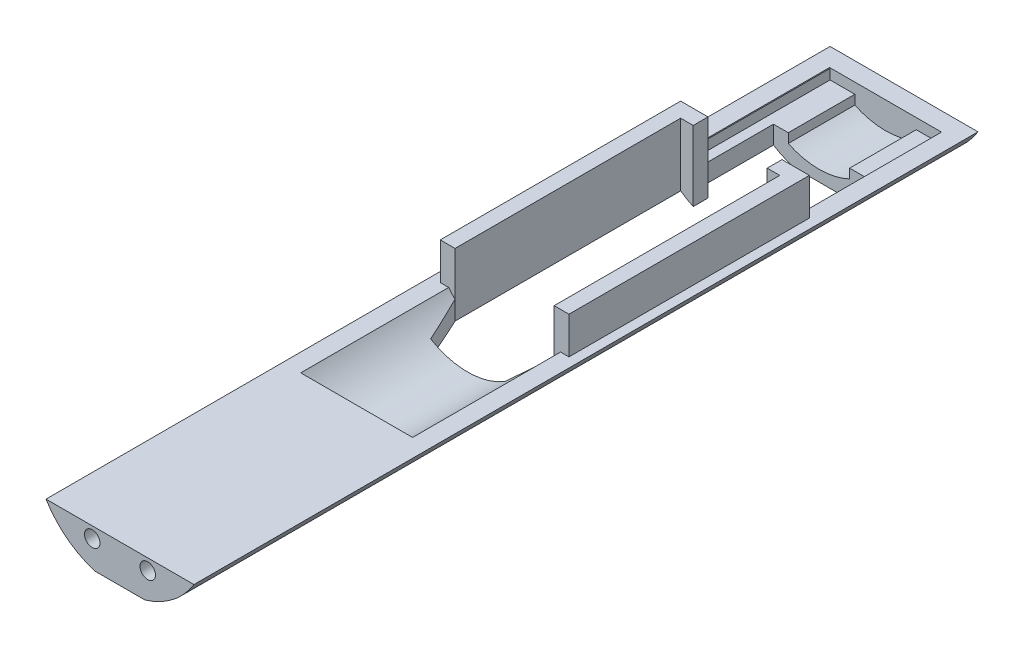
ISO-10303-21;
HEADER;
FILE_DESCRIPTION(('STEP AP214'),'2;1');
FILE_NAME('part.step','',(''),(''),'','','');
FILE_SCHEMA(('AUTOMOTIVE_DESIGN { 1 0 10303 214 1 1 1 1 }'));
ENDSEC;
DATA;
#1=APPLICATION_CONTEXT('core data for automotive mechanical design processes');
#2=APPLICATION_PROTOCOL_DEFINITION('international standard','automotive_design',2000,#1);
#3=PRODUCT_CONTEXT('',#1,'mechanical');
#4=PRODUCT('Part','Part','',(#3));
#5=PRODUCT_RELATED_PRODUCT_CATEGORY('part','',(#4));
#6=PRODUCT_DEFINITION_FORMATION('','',#4);
#7=PRODUCT_DEFINITION_CONTEXT('part definition',#1,'design');
#8=PRODUCT_DEFINITION('design','',#6,#7);
#9=PRODUCT_DEFINITION_SHAPE('','',#8);
#10=(LENGTH_UNIT() NAMED_UNIT(*) SI_UNIT(.MILLI.,.METRE.));
#11=(NAMED_UNIT(*) PLANE_ANGLE_UNIT() SI_UNIT($,.RADIAN.));
#12=(NAMED_UNIT(*) SI_UNIT($,.STERADIAN.) SOLID_ANGLE_UNIT());
#13=UNCERTAINTY_MEASURE_WITH_UNIT(LENGTH_MEASURE(1.E-05),#10,'distance_accuracy_value','');
#14=(GEOMETRIC_REPRESENTATION_CONTEXT(3) GLOBAL_UNCERTAINTY_ASSIGNED_CONTEXT((#13)) GLOBAL_UNIT_ASSIGNED_CONTEXT((#10,
#11,#12)) REPRESENTATION_CONTEXT('',''));
#15=CARTESIAN_POINT('',(0.,0.,0.));
#16=DIRECTION('',(0.,0.,1.));
#17=DIRECTION('',(1.,0.,0.));
#18=AXIS2_PLACEMENT_3D('',#15,#16,#17);
#19=CARTESIAN_POINT('',(0.,0.,-457.2));
#20=DIRECTION('',(0.,0.,1.));
#21=DIRECTION('',(1.,0.,0.));
#22=AXIS2_PLACEMENT_3D('',#19,#20,#21);
#23=CYLINDRICAL_SURFACE('',#22,29.718);
#24=CARTESIAN_POINT('',(0.,0.,-457.2));
#25=DIRECTION('',(0.,0.,1.));
#26=DIRECTION('',(1.,0.,0.));
#27=AXIS2_PLACEMENT_3D('',#24,#25,#26);
#28=CIRCLE('',#27,29.718);
#29=CARTESIAN_POINT('',(-8.59481355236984,-28.448,-457.2));
#30=VERTEX_POINT('',#29);
#31=CARTESIAN_POINT('',(-25.4,-15.4272331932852,-457.2));
#32=VERTEX_POINT('',#31);
#33=EDGE_CURVE('E483',#30,#32,#28,.F.);
#34=ORIENTED_EDGE('',*,*,#33,.F.);
#35=DIRECTION('',(0.,0.,1.));
#36=VECTOR('',#35,1.);
#37=CARTESIAN_POINT('',(-8.59481355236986,-28.448,-457.2));
#38=LINE('',#37,#36);
#39=CARTESIAN_POINT('',(-8.59481355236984,-28.448,-427.99));
#40=VERTEX_POINT('',#39);
#41=EDGE_CURVE('E719',#30,#40,#38,.T.);
#42=ORIENTED_EDGE('',*,*,#41,.T.);
#43=CARTESIAN_POINT('',(0.,0.,-427.99));
#44=DIRECTION('',(0.,0.,-1.));
#45=DIRECTION('',(-1.,0.,0.));
#46=AXIS2_PLACEMENT_3D('',#43,#44,#45);
#47=CIRCLE('',#46,29.718);
#48=CARTESIAN_POINT('',(-15.6246134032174,-25.2790620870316,-427.99));
#49=VERTEX_POINT('',#48);
#50=EDGE_CURVE('E533',#40,#49,#47,.T.);
#51=ORIENTED_EDGE('',*,*,#50,.T.);
#52=DIRECTION('',(0.,0.,1.));
#53=VECTOR('',#52,1.);
#54=CARTESIAN_POINT('',(-15.6246134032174,-25.2790620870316,-457.2));
#55=LINE('',#54,#53);
#56=CARTESIAN_POINT('',(-15.6246134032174,-25.2790620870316,-402.59));
#57=VERTEX_POINT('',#56);
#58=EDGE_CURVE('E89',#49,#57,#55,.T.);
#59=ORIENTED_EDGE('',*,*,#58,.T.);
#60=CARTESIAN_POINT('',(0.,0.,-402.59));
#61=DIRECTION('',(0.,0.,1.));
#62=DIRECTION('',(1.,0.,0.));
#63=AXIS2_PLACEMENT_3D('',#60,#61,#62);
#64=CIRCLE('',#63,29.718);
#65=CARTESIAN_POINT('',(-12.7,-26.8676296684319,-402.59));
#66=VERTEX_POINT('',#65);
#67=EDGE_CURVE('E544',#57,#66,#64,.T.);
#68=ORIENTED_EDGE('',*,*,#67,.T.);
#69=DIRECTION('',(0.,0.,1.));
#70=VECTOR('',#69,1.);
#71=CARTESIAN_POINT('',(-12.7,-26.8676296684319,-457.2));
#72=LINE('',#71,#70);
#73=CARTESIAN_POINT('',(-12.7,-26.8676296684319,-397.51));
#74=VERTEX_POINT('',#73);
#75=EDGE_CURVE('E595',#66,#74,#72,.T.);
#76=ORIENTED_EDGE('',*,*,#75,.T.);
#77=CARTESIAN_POINT('',(0.,0.,-397.51));
#78=DIRECTION('',(0.,0.,-1.));
#79=DIRECTION('',(-1.,0.,0.));
#80=AXIS2_PLACEMENT_3D('',#77,#78,#79);
#81=CIRCLE('',#80,29.718);
#82=CARTESIAN_POINT('',(-17.018,-24.3628241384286,-397.51));
#83=VERTEX_POINT('',#82);
#84=EDGE_CURVE('E519',#74,#83,#81,.T.);
#85=ORIENTED_EDGE('',*,*,#84,.T.);
#86=DIRECTION('',(0.,0.,1.));
#87=VECTOR('',#86,1.);
#88=CARTESIAN_POINT('',(-17.018,-24.3628241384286,-457.2));
#89=LINE('',#88,#87);
#90=CARTESIAN_POINT('',(-17.018,-24.3628241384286,-320.04));
#91=VERTEX_POINT('',#90);
#92=EDGE_CURVE('E524',#83,#91,#89,.T.);
#93=ORIENTED_EDGE('',*,*,#92,.T.);
#94=CARTESIAN_POINT('',(0.,0.,-269.987058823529));
#95=DIRECTION('',(-0.946772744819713,0.,0.321902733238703));
#96=DIRECTION('',(0.321902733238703,0.,0.946772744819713));
#97=AXIS2_PLACEMENT_3D('',#94,#95,#96);
#98=ELLIPSE('',#97,92.3198125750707,29.718);
#99=CARTESIAN_POINT('',(-12.7,-26.8676296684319,-307.34));
#100=VERTEX_POINT('',#99);
#101=EDGE_CURVE('E529',#91,#100,#98,.T.);
#102=ORIENTED_EDGE('',*,*,#101,.T.);
#103=CARTESIAN_POINT('',(0.,0.,-307.34));
#104=DIRECTION('',(0.,0.,1.));
#105=DIRECTION('',(1.,0.,0.));
#106=AXIS2_PLACEMENT_3D('',#103,#104,#105);
#107=CIRCLE('',#106,29.718);
#108=CARTESIAN_POINT('',(-8.59481355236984,-28.448,-307.34));
#109=VERTEX_POINT('',#108);
#110=EDGE_CURVE('E506',#100,#109,#107,.T.);
#111=ORIENTED_EDGE('',*,*,#110,.T.);
#112=CARTESIAN_POINT('',(-8.59481355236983,-28.448,-187.96));
#113=VERTEX_POINT('',#112);
#114=EDGE_CURVE('E93',#109,#113,#38,.T.);
#115=ORIENTED_EDGE('',*,*,#114,.T.);
#116=CARTESIAN_POINT('',(0.,0.,-187.96));
#117=DIRECTION('',(0.,0.,-1.));
#118=DIRECTION('',(-1.,0.,0.));
#119=AXIS2_PLACEMENT_3D('',#116,#117,#118);
#120=CIRCLE('',#119,29.718);
#121=CARTESIAN_POINT('',(-25.4,-15.4272331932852,-187.96));
#122=VERTEX_POINT('',#121);
#123=EDGE_CURVE('E335',#113,#122,#120,.T.);
#124=ORIENTED_EDGE('',*,*,#123,.T.);
#125=DIRECTION('',(0.,0.,1.));
#126=VECTOR('',#125,1.);
#127=CARTESIAN_POINT('',(-25.4,-15.4272331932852,-457.2));
#128=LINE('',#127,#126);
#129=EDGE_CURVE('E494',#32,#122,#128,.T.);
#130=ORIENTED_EDGE('',*,*,#129,.F.);
#131=EDGE_LOOP('',(#34,#42,#51,#59,#68,#76,#85,#93,#102,#111,#115,#124,#130));
#132=FACE_BOUND('',#131,.T.);
#133=ADVANCED_FACE('F79',(#132),#23,.T.);
#134=CARTESIAN_POINT('',(25.3999999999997,-286.302365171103,-187.96));
#135=DIRECTION('',(0.,0.,-1.));
#136=DIRECTION('',(-1.,0.,0.));
#137=AXIS2_PLACEMENT_3D('',#134,#135,#136);
#138=PLANE('',#137);
#139=CARTESIAN_POINT('',(9.52500000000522,-19.2372331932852,-187.96));
#140=DIRECTION('',(0.,0.,1.));
#141=DIRECTION('',(1.,0.,0.));
#142=AXIS2_PLACEMENT_3D('',#139,#140,#141);
#143=CIRCLE('',#142,2.64999999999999);
#144=CARTESIAN_POINT('',(12.1750000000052,-19.2372331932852,-187.96));
#145=VERTEX_POINT('',#144);
#146=EDGE_CURVE('E704',#145,#145,#143,.T.);
#147=ORIENTED_EDGE('',*,*,#146,.F.);
#148=EDGE_LOOP('',(#147));
#149=FACE_BOUND('',#148,.T.);
#150=CARTESIAN_POINT('',(-9.52499999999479,-19.2372331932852,-187.96));
#151=DIRECTION('',(0.,0.,1.));
#152=DIRECTION('',(1.,0.,0.));
#153=AXIS2_PLACEMENT_3D('',#150,#151,#152);
#154=CIRCLE('',#153,2.64999999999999);
#155=CARTESIAN_POINT('',(-6.8749999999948,-19.2372331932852,-187.96));
#156=VERTEX_POINT('',#155);
#157=EDGE_CURVE('E706',#156,#156,#154,.T.);
#158=ORIENTED_EDGE('',*,*,#157,.F.);
#159=EDGE_LOOP('',(#158));
#160=FACE_BOUND('',#159,.T.);
#161=DIRECTION('',(-1.,0.,0.));
#162=VECTOR('',#161,1.);
#163=CARTESIAN_POINT('',(0.,-28.448,-187.96));
#164=LINE('',#163,#162);
#165=CARTESIAN_POINT('',(8.59481355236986,-28.448,-187.96));
#166=VERTEX_POINT('',#165);
#167=EDGE_CURVE('E316',#166,#113,#164,.T.);
#168=ORIENTED_EDGE('',*,*,#167,.F.);
#169=CARTESIAN_POINT('',(25.4,-15.4272331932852,-187.96));
#170=VERTEX_POINT('',#169);
#171=EDGE_CURVE('E332',#170,#166,#120,.T.);
#172=ORIENTED_EDGE('',*,*,#171,.F.);
#173=DIRECTION('',(-1.,0.,0.));
#174=VECTOR('',#173,1.);
#175=CARTESIAN_POINT('',(25.4,-15.4272331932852,-187.96));
#176=LINE('',#175,#174);
#177=EDGE_CURVE('E476',#170,#122,#176,.T.);
#178=ORIENTED_EDGE('',*,*,#177,.T.);
#179=ORIENTED_EDGE('',*,*,#123,.F.);
#180=EDGE_LOOP('',(#168,#172,#178,#179));
#181=FACE_BOUND('',#180,.T.);
#182=ADVANCED_FACE('F328',(#149,#160,#181),#138,.F.);
#183=CARTESIAN_POINT('',(25.4,-29.719,-450.85));
#184=DIRECTION('',(0.,0.,1.));
#185=DIRECTION('',(1.,0.,0.));
#186=AXIS2_PLACEMENT_3D('',#183,#184,#185);
#187=PLANE('',#186);
#188=DIRECTION('',(-1.,0.,0.));
#189=VECTOR('',#188,1.);
#190=CARTESIAN_POINT('',(-19.05,-19.05,-450.85));
#191=LINE('',#190,#189);
#192=CARTESIAN_POINT('',(-10.5446134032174,-19.05,-450.85));
#193=VERTEX_POINT('',#192);
#194=CARTESIAN_POINT('',(-19.05,-19.05,-450.85));
#195=VERTEX_POINT('',#194);
#196=EDGE_CURVE('E618',#193,#195,#191,.T.);
#197=ORIENTED_EDGE('',*,*,#196,.F.);
#198=DIRECTION('',(0.,1.,0.));
#199=VECTOR('',#198,1.);
#200=CARTESIAN_POINT('',(-10.5446134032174,-29.719,-450.85));
#201=LINE('',#200,#199);
#202=CARTESIAN_POINT('',(-10.5446134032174,-22.2675138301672,-450.85));
#203=VERTEX_POINT('',#202);
#204=EDGE_CURVE('E690',#203,#193,#201,.T.);
#205=ORIENTED_EDGE('',*,*,#204,.F.);
#206=CARTESIAN_POINT('',(0.,0.,-450.85));
#207=DIRECTION('',(0.,0.,1.));
#208=DIRECTION('',(1.,0.,0.));
#209=AXIS2_PLACEMENT_3D('',#206,#207,#208);
#210=CIRCLE('',#209,24.638);
#211=CARTESIAN_POINT('',(10.5446134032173,-22.2675138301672,-450.85));
#212=VERTEX_POINT('',#211);
#213=EDGE_CURVE('E379',#203,#212,#210,.T.);
#214=ORIENTED_EDGE('',*,*,#213,.T.);
#215=DIRECTION('',(0.,1.,0.));
#216=VECTOR('',#215,1.);
#217=CARTESIAN_POINT('',(10.5446134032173,-29.719,-450.85));
#218=LINE('',#217,#216);
#219=CARTESIAN_POINT('',(10.5446134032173,-19.05,-450.85));
#220=VERTEX_POINT('',#219);
#221=EDGE_CURVE('E681',#212,#220,#218,.T.);
#222=ORIENTED_EDGE('',*,*,#221,.T.);
#223=CARTESIAN_POINT('',(19.05,-19.05,-450.85));
#224=VERTEX_POINT('',#223);
#225=EDGE_CURVE('E615',#224,#220,#191,.T.);
#226=ORIENTED_EDGE('',*,*,#225,.F.);
#227=DIRECTION('',(0.,-1.,0.));
#228=VECTOR('',#227,1.);
#229=CARTESIAN_POINT('',(19.05,-19.05,-450.85));
#230=LINE('',#229,#228);
#231=CARTESIAN_POINT('',(19.05,-15.6246134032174,-450.85));
#232=VERTEX_POINT('',#231);
#233=EDGE_CURVE('E609',#232,#224,#230,.T.);
#234=ORIENTED_EDGE('',*,*,#233,.F.);
#235=CARTESIAN_POINT('',(19.2101931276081,-15.4272331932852,-450.85));
#236=VERTEX_POINT('',#235);
#237=EDGE_CURVE('E372',#232,#236,#210,.T.);
#238=ORIENTED_EDGE('',*,*,#237,.T.);
#239=DIRECTION('',(1.,0.,0.));
#240=VECTOR('',#239,1.);
#241=CARTESIAN_POINT('',(25.4,-15.4272331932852,-450.85));
#242=LINE('',#241,#240);
#243=CARTESIAN_POINT('',(-19.2101931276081,-15.4272331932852,-450.85));
#244=VERTEX_POINT('',#243);
#245=EDGE_CURVE('E371',#244,#236,#242,.T.);
#246=ORIENTED_EDGE('',*,*,#245,.F.);
#247=CARTESIAN_POINT('',(-19.05,-15.6246134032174,-450.85));
#248=VERTEX_POINT('',#247);
#249=EDGE_CURVE('E374',#244,#248,#210,.T.);
#250=ORIENTED_EDGE('',*,*,#249,.T.);
#251=DIRECTION('',(0.,1.,0.));
#252=VECTOR('',#251,1.);
#253=CARTESIAN_POINT('',(-19.05,-19.05,-450.85));
#254=LINE('',#253,#252);
#255=EDGE_CURVE('E608',#195,#248,#254,.T.);
#256=ORIENTED_EDGE('',*,*,#255,.F.);
#257=EDGE_LOOP('',(#197,#205,#214,#222,#226,#234,#238,#246,#250,#256));
#258=FACE_BOUND('',#257,.T.);
#259=ADVANCED_FACE('F745',(#258),#187,.T.);
#260=CARTESIAN_POINT('',(0.,-2.72723319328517,0.));
#261=DIRECTION('',(0.,1.,0.));
#262=DIRECTION('',(0.,0.,1.));
#263=AXIS2_PLACEMENT_3D('',#260,#261,#262);
#264=PLANE('',#263);
#265=DIRECTION('',(0.,0.,1.));
#266=VECTOR('',#265,1.);
#267=CARTESIAN_POINT('',(-12.7,-2.72723319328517,-397.51));
#268=LINE('',#267,#266);
#269=CARTESIAN_POINT('',(-12.7,-2.72723319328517,-402.59));
#270=VERTEX_POINT('',#269);
#271=CARTESIAN_POINT('',(-12.7,-2.72723319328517,-397.51));
#272=VERTEX_POINT('',#271);
#273=EDGE_CURVE('E585',#270,#272,#268,.T.);
#274=ORIENTED_EDGE('',*,*,#273,.F.);
#275=DIRECTION('',(-1.,0.,0.));
#276=VECTOR('',#275,1.);
#277=CARTESIAN_POINT('',(22.098,-2.72723319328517,-402.59));
#278=LINE('',#277,#276);
#279=CARTESIAN_POINT('',(-22.098,-2.72723319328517,-402.59));
#280=VERTEX_POINT('',#279);
#281=EDGE_CURVE('E403',#270,#280,#278,.T.);
#282=ORIENTED_EDGE('',*,*,#281,.T.);
#283=DIRECTION('',(0.,0.,1.));
#284=VECTOR('',#283,1.);
#285=CARTESIAN_POINT('',(-22.098,-2.72723319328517,-402.59));
#286=LINE('',#285,#284);
#287=CARTESIAN_POINT('',(-22.098,-2.72723319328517,-320.04));
#288=VERTEX_POINT('',#287);
#289=EDGE_CURVE('E408',#280,#288,#286,.T.);
#290=ORIENTED_EDGE('',*,*,#289,.T.);
#291=DIRECTION('',(1.,0.,0.));
#292=VECTOR('',#291,1.);
#293=CARTESIAN_POINT('',(-22.098,-2.72723319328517,-320.04));
#294=LINE('',#293,#292);
#295=CARTESIAN_POINT('',(-17.018,-2.72723319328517,-320.04));
#296=VERTEX_POINT('',#295);
#297=EDGE_CURVE('E414',#288,#296,#294,.T.);
#298=ORIENTED_EDGE('',*,*,#297,.T.);
#299=DIRECTION('',(0.,0.,-1.));
#300=VECTOR('',#299,1.);
#301=CARTESIAN_POINT('',(-17.018,-2.72723319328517,-320.04));
#302=LINE('',#301,#300);
#303=CARTESIAN_POINT('',(-17.018,-2.72723319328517,-397.51));
#304=VERTEX_POINT('',#303);
#305=EDGE_CURVE('E417',#296,#304,#302,.T.);
#306=ORIENTED_EDGE('',*,*,#305,.T.);
#307=DIRECTION('',(1.,0.,0.));
#308=VECTOR('',#307,1.);
#309=CARTESIAN_POINT('',(-17.018,-2.72723319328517,-397.51));
#310=LINE('',#309,#308);
#311=EDGE_CURVE('E418',#304,#272,#310,.T.);
#312=ORIENTED_EDGE('',*,*,#311,.T.);
#313=EDGE_LOOP('',(#274,#282,#290,#298,#306,#312));
#314=FACE_BOUND('',#313,.T.);
#315=ADVANCED_FACE('F850',(#314),#264,.T.);
#316=CARTESIAN_POINT('',(22.098,-2.72723319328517,-402.59));
#317=DIRECTION('',(0.,0.,1.));
#318=DIRECTION('',(1.,0.,0.));
#319=AXIS2_PLACEMENT_3D('',#316,#317,#318);
#320=PLANE('',#319);
#321=ORIENTED_EDGE('',*,*,#281,.F.);
#322=DIRECTION('',(0.,1.,0.));
#323=VECTOR('',#322,1.);
#324=CARTESIAN_POINT('',(-12.7,-29.718,-402.59));
#325=LINE('',#324,#323);
#326=EDGE_CURVE('E588',#66,#270,#325,.T.);
#327=ORIENTED_EDGE('',*,*,#326,.F.);
#328=ORIENTED_EDGE('',*,*,#67,.F.);
#329=DIRECTION('',(0.,1.,0.));
#330=VECTOR('',#329,1.);
#331=CARTESIAN_POINT('',(-15.6246134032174,-29.718,-402.59));
#332=LINE('',#331,#330);
#333=CARTESIAN_POINT('',(-15.6246134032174,-19.05,-402.59));
#334=VERTEX_POINT('',#333);
#335=EDGE_CURVE('E555',#57,#334,#332,.T.);
#336=ORIENTED_EDGE('',*,*,#335,.T.);
#337=DIRECTION('',(-1.,0.,0.));
#338=VECTOR('',#337,1.);
#339=CARTESIAN_POINT('',(-19.05,-19.05,-402.59));
#340=LINE('',#339,#338);
#341=CARTESIAN_POINT('',(-19.05,-19.05,-402.59));
#342=VERTEX_POINT('',#341);
#343=EDGE_CURVE('E614',#334,#342,#340,.T.);
#344=ORIENTED_EDGE('',*,*,#343,.T.);
#345=DIRECTION('',(0.,1.,0.));
#346=VECTOR('',#345,1.);
#347=CARTESIAN_POINT('',(-19.05,-19.05,-402.59));
#348=LINE('',#347,#346);
#349=CARTESIAN_POINT('',(-19.05,-15.6246134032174,-402.59));
#350=VERTEX_POINT('',#349);
#351=EDGE_CURVE('E628',#342,#350,#348,.T.);
#352=ORIENTED_EDGE('',*,*,#351,.T.);
#353=CARTESIAN_POINT('',(0.,0.,-402.59));
#354=DIRECTION('',(0.,0.,-1.));
#355=DIRECTION('',(-1.,0.,0.));
#356=AXIS2_PLACEMENT_3D('',#353,#354,#355);
#357=CIRCLE('',#356,24.638);
#358=CARTESIAN_POINT('',(-19.2101931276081,-15.4272331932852,-402.59));
#359=VERTEX_POINT('',#358);
#360=EDGE_CURVE('E388',#359,#350,#357,.F.);
#361=ORIENTED_EDGE('',*,*,#360,.F.);
#362=DIRECTION('',(-1.,0.,0.));
#363=VECTOR('',#362,1.);
#364=CARTESIAN_POINT('',(22.098,-15.4272331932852,-402.59));
#365=LINE('',#364,#363);
#366=CARTESIAN_POINT('',(-22.098,-15.4272331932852,-402.59));
#367=VERTEX_POINT('',#366);
#368=EDGE_CURVE('E427',#359,#367,#365,.T.);
#369=ORIENTED_EDGE('',*,*,#368,.T.);
#370=DIRECTION('',(0.,-1.,0.));
#371=VECTOR('',#370,1.);
#372=CARTESIAN_POINT('',(-22.098,-2.72723319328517,-402.59));
#373=LINE('',#372,#371);
#374=EDGE_CURVE('E451',#280,#367,#373,.T.);
#375=ORIENTED_EDGE('',*,*,#374,.F.);
#376=EDGE_LOOP('',(#321,#327,#328,#336,#344,#352,#361,#369,#375));
#377=FACE_BOUND('',#376,.T.);
#378=ADVANCED_FACE('F832',(#377),#320,.F.);
#379=CARTESIAN_POINT('',(-17.018,-2.72723319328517,-397.51));
#380=DIRECTION('',(0.,0.,-1.));
#381=DIRECTION('',(-1.,0.,0.));
#382=AXIS2_PLACEMENT_3D('',#379,#380,#381);
#383=PLANE('',#382);
#384=DIRECTION('',(0.,1.,0.));
#385=VECTOR('',#384,1.);
#386=CARTESIAN_POINT('',(12.7,-29.718,-397.51));
#387=LINE('',#386,#385);
#388=CARTESIAN_POINT('',(12.7,-26.8676296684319,-397.51));
#389=VERTEX_POINT('',#388);
#390=CARTESIAN_POINT('',(12.7,-2.72723319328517,-397.51));
#391=VERTEX_POINT('',#390);
#392=EDGE_CURVE('E532',#389,#391,#387,.T.);
#393=ORIENTED_EDGE('',*,*,#392,.F.);
#394=CARTESIAN_POINT('',(17.018,-24.3628241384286,-397.51));
#395=VERTEX_POINT('',#394);
#396=EDGE_CURVE('E516',#395,#389,#81,.T.);
#397=ORIENTED_EDGE('',*,*,#396,.F.);
#398=DIRECTION('',(0.,-1.,0.));
#399=VECTOR('',#398,1.);
#400=CARTESIAN_POINT('',(17.018,-2.72723319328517,-397.51));
#401=LINE('',#400,#399);
#402=CARTESIAN_POINT('',(17.018,-2.72723319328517,-397.51));
#403=VERTEX_POINT('',#402);
#404=EDGE_CURVE('E425',#403,#395,#401,.T.);
#405=ORIENTED_EDGE('',*,*,#404,.F.);
#406=EDGE_CURVE('E416',#391,#403,#310,.T.);
#407=ORIENTED_EDGE('',*,*,#406,.F.);
#408=EDGE_LOOP('',(#393,#397,#405,#407));
#409=FACE_BOUND('',#408,.T.);
#410=ADVANCED_FACE('F846',(#409),#383,.F.);
#411=CARTESIAN_POINT('',(0.,0.,-457.2));
#412=DIRECTION('',(0.,0.,1.));
#413=DIRECTION('',(1.,0.,0.));
#414=AXIS2_PLACEMENT_3D('',#411,#412,#413);
#415=CYLINDRICAL_SURFACE('',#414,24.638);
#416=DIRECTION('',(0.,0.,1.));
#417=VECTOR('',#416,1.);
#418=CARTESIAN_POINT('',(-10.5446134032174,-22.2675138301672,-457.2));
#419=LINE('',#418,#417);
#420=CARTESIAN_POINT('',(-10.5446134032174,-22.2675138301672,-427.99));
#421=VERTEX_POINT('',#420);
#422=EDGE_CURVE('E663',#421,#203,#419,.F.);
#423=ORIENTED_EDGE('',*,*,#422,.F.);
#424=CARTESIAN_POINT('',(0.,0.,-427.99));
#425=DIRECTION('',(0.,0.,-1.));
#426=DIRECTION('',(-1.,0.,0.));
#427=AXIS2_PLACEMENT_3D('',#424,#425,#426);
#428=CIRCLE('',#427,24.638);
#429=CARTESIAN_POINT('',(10.5446134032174,-22.2675138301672,-427.99));
#430=VERTEX_POINT('',#429);
#431=EDGE_CURVE('E579',#430,#421,#428,.T.);
#432=ORIENTED_EDGE('',*,*,#431,.F.);
#433=DIRECTION('',(0.,0.,1.));
#434=VECTOR('',#433,1.);
#435=CARTESIAN_POINT('',(10.5446134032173,-22.2675138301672,-457.2));
#436=LINE('',#435,#434);
#437=EDGE_CURVE('E666',#212,#430,#436,.T.);
#438=ORIENTED_EDGE('',*,*,#437,.F.);
#439=ORIENTED_EDGE('',*,*,#213,.F.);
#440=EDGE_LOOP('',(#423,#432,#438,#439));
#441=FACE_BOUND('',#440,.T.);
#442=ADVANCED_FACE('F1057',(#441),#415,.F.);
#443=DIRECTION('',(0.,0.,1.));
#444=VECTOR('',#443,1.);
#445=CARTESIAN_POINT('',(-19.05,-15.6246134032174,-457.2));
#446=LINE('',#445,#444);
#447=EDGE_CURVE('E639',#248,#350,#446,.T.);
#448=ORIENTED_EDGE('',*,*,#447,.F.);
#449=ORIENTED_EDGE('',*,*,#249,.F.);
#450=DIRECTION('',(0.,0.,1.));
#451=VECTOR('',#450,1.);
#452=CARTESIAN_POINT('',(-19.2101931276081,-15.4272331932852,-457.2));
#453=LINE('',#452,#451);
#454=EDGE_CURVE('E498',#244,#359,#453,.T.);
#455=ORIENTED_EDGE('',*,*,#454,.T.);
#456=ORIENTED_EDGE('',*,*,#360,.T.);
#457=EDGE_LOOP('',(#448,#449,#455,#456));
#458=FACE_BOUND('',#457,.T.);
#459=ADVANCED_FACE('F1087',(#458),#415,.F.);
#460=DIRECTION('',(0.,0.,1.));
#461=VECTOR('',#460,1.);
#462=CARTESIAN_POINT('',(19.05,-15.6246134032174,-457.2));
#463=LINE('',#462,#461);
#464=CARTESIAN_POINT('',(19.05,-15.6246134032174,-402.59));
#465=VERTEX_POINT('',#464);
#466=EDGE_CURVE('E637',#465,#232,#463,.F.);
#467=ORIENTED_EDGE('',*,*,#466,.F.);
#468=CARTESIAN_POINT('',(19.2101931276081,-15.4272331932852,-402.59));
#469=VERTEX_POINT('',#468);
#470=EDGE_CURVE('E381',#465,#469,#357,.F.);
#471=ORIENTED_EDGE('',*,*,#470,.T.);
#472=DIRECTION('',(0.,0.,1.));
#473=VECTOR('',#472,1.);
#474=CARTESIAN_POINT('',(19.2101931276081,-15.4272331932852,-457.2));
#475=LINE('',#474,#473);
#476=EDGE_CURVE('E505',#236,#469,#475,.T.);
#477=ORIENTED_EDGE('',*,*,#476,.F.);
#478=ORIENTED_EDGE('',*,*,#237,.F.);
#479=EDGE_LOOP('',(#467,#471,#477,#478));
#480=FACE_BOUND('',#479,.T.);
#481=ADVANCED_FACE('F82',(#480),#415,.F.);
#482=CARTESIAN_POINT('',(0.,0.,-269.98705882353));
#483=DIRECTION('',(0.946772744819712,0.,0.321902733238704));
#484=DIRECTION('',(-0.321902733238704,0.,0.946772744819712));
#485=AXIS2_PLACEMENT_3D('',#482,#483,#484);
#486=ELLIPSE('',#485,76.5386480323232,24.638);
#487=CARTESIAN_POINT('',(12.7,-21.1125802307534,-307.34));
#488=VERTEX_POINT('',#487);
#489=CARTESIAN_POINT('',(17.018,-17.8162487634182,-320.04));
#490=VERTEX_POINT('',#489);
#491=EDGE_CURVE('E368',#488,#490,#486,.T.);
#492=ORIENTED_EDGE('',*,*,#491,.F.);
#493=CARTESIAN_POINT('',(0.,0.,-307.34));
#494=DIRECTION('',(0.,0.,1.));
#495=DIRECTION('',(1.,0.,0.));
#496=AXIS2_PLACEMENT_3D('',#493,#494,#495);
#497=CIRCLE('',#496,24.638);
#498=CARTESIAN_POINT('',(-12.7,-21.1125802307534,-307.34));
#499=VERTEX_POINT('',#498);
#500=EDGE_CURVE('E362',#499,#488,#497,.T.);
#501=ORIENTED_EDGE('',*,*,#500,.F.);
#502=CARTESIAN_POINT('',(0.,0.,-269.987058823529));
#503=DIRECTION('',(-0.946772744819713,0.,0.321902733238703));
#504=DIRECTION('',(0.321902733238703,0.,0.946772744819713));
#505=AXIS2_PLACEMENT_3D('',#502,#503,#504);
#506=ELLIPSE('',#505,76.5386480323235,24.638);
#507=CARTESIAN_POINT('',(-17.018,-17.8162487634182,-320.04));
#508=VERTEX_POINT('',#507);
#509=EDGE_CURVE('E353',#508,#499,#506,.T.);
#510=ORIENTED_EDGE('',*,*,#509,.F.);
#511=CARTESIAN_POINT('',(0.,0.,-320.04));
#512=DIRECTION('',(0.,0.,1.));
#513=DIRECTION('',(1.,0.,0.));
#514=AXIS2_PLACEMENT_3D('',#511,#512,#513);
#515=CIRCLE('',#514,24.638);
#516=CARTESIAN_POINT('',(-19.2101931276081,-15.4272331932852,-320.04));
#517=VERTEX_POINT('',#516);
#518=EDGE_CURVE('E383',#508,#517,#515,.F.);
#519=ORIENTED_EDGE('',*,*,#518,.T.);
#520=CARTESIAN_POINT('',(-19.2101931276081,-15.4272331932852,-269.24));
#521=VERTEX_POINT('',#520);
#522=EDGE_CURVE('E501',#517,#521,#453,.T.);
#523=ORIENTED_EDGE('',*,*,#522,.T.);
#524=CARTESIAN_POINT('',(0.,0.,-269.24));
#525=DIRECTION('',(0.,0.,-1.));
#526=DIRECTION('',(-1.,0.,0.));
#527=AXIS2_PLACEMENT_3D('',#524,#525,#526);
#528=CIRCLE('',#527,24.638);
#529=CARTESIAN_POINT('',(19.2101931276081,-15.4272331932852,-269.24));
#530=VERTEX_POINT('',#529);
#531=EDGE_CURVE('E472',#521,#530,#528,.F.);
#532=ORIENTED_EDGE('',*,*,#531,.T.);
#533=CARTESIAN_POINT('',(19.2101931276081,-15.4272331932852,-320.04));
#534=VERTEX_POINT('',#533);
#535=EDGE_CURVE('E489',#534,#530,#475,.T.);
#536=ORIENTED_EDGE('',*,*,#535,.F.);
#537=CARTESIAN_POINT('',(0.,0.,-320.04));
#538=DIRECTION('',(0.,0.,1.));
#539=DIRECTION('',(1.,0.,0.));
#540=AXIS2_PLACEMENT_3D('',#537,#538,#539);
#541=CIRCLE('',#540,24.638);
#542=EDGE_CURVE('E378',#534,#490,#541,.F.);
#543=ORIENTED_EDGE('',*,*,#542,.T.);
#544=EDGE_LOOP('',(#492,#501,#510,#519,#523,#532,#536,#543));
#545=FACE_BOUND('',#544,.T.);
#546=ADVANCED_FACE('F766',(#545),#415,.F.);
#547=ORIENTED_EDGE('',*,*,#171,.T.);
#548=DIRECTION('',(0.,0.,1.));
#549=VECTOR('',#548,1.);
#550=CARTESIAN_POINT('',(8.59481355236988,-28.448,-457.2));
#551=LINE('',#550,#549);
#552=CARTESIAN_POINT('',(8.59481355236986,-28.448,-307.34));
#553=VERTEX_POINT('',#552);
#554=EDGE_CURVE('E317',#166,#553,#551,.F.);
#555=ORIENTED_EDGE('',*,*,#554,.T.);
#556=CARTESIAN_POINT('',(12.7,-26.8676296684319,-307.34));
#557=VERTEX_POINT('',#556);
#558=EDGE_CURVE('E491',#553,#557,#107,.T.);
#559=ORIENTED_EDGE('',*,*,#558,.T.);
#560=CARTESIAN_POINT('',(0.,0.,-269.98705882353));
#561=DIRECTION('',(0.946772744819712,0.,0.321902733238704));
#562=DIRECTION('',(-0.321902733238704,0.,0.946772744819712));
#563=AXIS2_PLACEMENT_3D('',#560,#561,#562);
#564=ELLIPSE('',#563,92.3198125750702,29.718);
#565=CARTESIAN_POINT('',(17.018,-24.3628241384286,-320.04));
#566=VERTEX_POINT('',#565);
#567=EDGE_CURVE('E509',#557,#566,#564,.T.);
#568=ORIENTED_EDGE('',*,*,#567,.T.);
#569=DIRECTION('',(0.,0.,1.));
#570=VECTOR('',#569,1.);
#571=CARTESIAN_POINT('',(17.018,-24.3628241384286,-457.2));
#572=LINE('',#571,#570);
#573=EDGE_CURVE('E511',#566,#395,#572,.F.);
#574=ORIENTED_EDGE('',*,*,#573,.T.);
#575=ORIENTED_EDGE('',*,*,#396,.T.);
#576=DIRECTION('',(0.,0.,1.));
#577=VECTOR('',#576,1.);
#578=CARTESIAN_POINT('',(12.7,-26.8676296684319,-457.2));
#579=LINE('',#578,#577);
#580=CARTESIAN_POINT('',(12.7,-26.8676296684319,-402.59));
#581=VERTEX_POINT('',#580);
#582=EDGE_CURVE('E601',#389,#581,#579,.F.);
#583=ORIENTED_EDGE('',*,*,#582,.T.);
#584=CARTESIAN_POINT('',(15.6246134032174,-25.2790620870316,-402.59));
#585=VERTEX_POINT('',#584);
#586=EDGE_CURVE('E573',#581,#585,#64,.T.);
#587=ORIENTED_EDGE('',*,*,#586,.T.);
#588=DIRECTION('',(0.,0.,1.));
#589=VECTOR('',#588,1.);
#590=CARTESIAN_POINT('',(15.6246134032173,-25.2790620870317,-457.2));
#591=LINE('',#590,#589);
#592=CARTESIAN_POINT('',(15.6246134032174,-25.2790620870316,-427.99));
#593=VERTEX_POINT('',#592);
#594=EDGE_CURVE('E572',#585,#593,#591,.F.);
#595=ORIENTED_EDGE('',*,*,#594,.T.);
#596=CARTESIAN_POINT('',(8.59481355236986,-28.448,-427.99));
#597=VERTEX_POINT('',#596);
#598=EDGE_CURVE('E535',#593,#597,#47,.T.);
#599=ORIENTED_EDGE('',*,*,#598,.T.);
#600=CARTESIAN_POINT('',(8.59481355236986,-28.448,-457.2));
#601=VERTEX_POINT('',#600);
#602=EDGE_CURVE('E101',#597,#601,#551,.F.);
#603=ORIENTED_EDGE('',*,*,#602,.T.);
#604=CARTESIAN_POINT('',(25.4,-15.4272331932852,-457.2));
#605=VERTEX_POINT('',#604);
#606=EDGE_CURVE('E488',#605,#601,#28,.F.);
#607=ORIENTED_EDGE('',*,*,#606,.F.);
#608=DIRECTION('',(0.,0.,1.));
#609=VECTOR('',#608,1.);
#610=CARTESIAN_POINT('',(25.4,-15.4272331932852,-457.2));
#611=LINE('',#610,#609);
#612=EDGE_CURVE('E339',#605,#170,#611,.T.);
#613=ORIENTED_EDGE('',*,*,#612,.T.);
#614=EDGE_LOOP('',(#547,#555,#559,#568,#574,#575,#583,#587,#595,#599,#603,#607,#613));
#615=FACE_BOUND('',#614,.T.);
#616=ADVANCED_FACE('F340',(#615),#23,.T.);
#617=CARTESIAN_POINT('',(0.,-15.4272331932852,-457.2));
#618=DIRECTION('',(0.,1.,0.));
#619=DIRECTION('',(-1.,0.,0.));
#620=AXIS2_PLACEMENT_3D('',#617,#618,#619);
#621=PLANE('',#620);
#622=ORIENTED_EDGE('',*,*,#177,.F.);
#623=ORIENTED_EDGE('',*,*,#612,.F.);
#624=DIRECTION('',(1.,0.,0.));
#625=VECTOR('',#624,1.);
#626=CARTESIAN_POINT('',(0.,-15.4272331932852,-457.2));
#627=LINE('',#626,#625);
#628=EDGE_CURVE('E473',#32,#605,#627,.T.);
#629=ORIENTED_EDGE('',*,*,#628,.F.);
#630=ORIENTED_EDGE('',*,*,#129,.T.);
#631=EDGE_LOOP('',(#622,#623,#629,#630));
#632=FACE_BOUND('',#631,.T.);
#633=ORIENTED_EDGE('',*,*,#454,.F.);
#634=ORIENTED_EDGE('',*,*,#245,.T.);
#635=ORIENTED_EDGE('',*,*,#476,.T.);
#636=CARTESIAN_POINT('',(22.098,-15.4272331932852,-402.59));
#637=VERTEX_POINT('',#636);
#638=EDGE_CURVE('E431',#637,#469,#365,.T.);
#639=ORIENTED_EDGE('',*,*,#638,.F.);
#640=DIRECTION('',(0.,0.,-1.));
#641=VECTOR('',#640,1.);
#642=CARTESIAN_POINT('',(22.098,-15.4272331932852,-320.04));
#643=LINE('',#642,#641);
#644=CARTESIAN_POINT('',(22.098,-15.4272331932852,-320.04));
#645=VERTEX_POINT('',#644);
#646=EDGE_CURVE('E430',#645,#637,#643,.T.);
#647=ORIENTED_EDGE('',*,*,#646,.F.);
#648=DIRECTION('',(1.,0.,0.));
#649=VECTOR('',#648,1.);
#650=CARTESIAN_POINT('',(17.018,-15.4272331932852,-320.04));
#651=LINE('',#650,#649);
#652=EDGE_CURVE('E386',#534,#645,#651,.T.);
#653=ORIENTED_EDGE('',*,*,#652,.F.);
#654=ORIENTED_EDGE('',*,*,#535,.T.);
#655=DIRECTION('',(-1.,0.,0.));
#656=VECTOR('',#655,1.);
#657=CARTESIAN_POINT('',(25.4,-15.4272331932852,-269.24));
#658=LINE('',#657,#656);
#659=EDGE_CURVE('E468',#530,#521,#658,.T.);
#660=ORIENTED_EDGE('',*,*,#659,.T.);
#661=ORIENTED_EDGE('',*,*,#522,.F.);
#662=DIRECTION('',(1.,0.,0.));
#663=VECTOR('',#662,1.);
#664=CARTESIAN_POINT('',(-22.098,-15.4272331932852,-320.04));
#665=LINE('',#664,#663);
#666=CARTESIAN_POINT('',(-22.098,-15.4272331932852,-320.04));
#667=VERTEX_POINT('',#666);
#668=EDGE_CURVE('E396',#667,#517,#665,.T.);
#669=ORIENTED_EDGE('',*,*,#668,.F.);
#670=DIRECTION('',(0.,0.,1.));
#671=VECTOR('',#670,1.);
#672=CARTESIAN_POINT('',(-22.098,-15.4272331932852,-402.59));
#673=LINE('',#672,#671);
#674=EDGE_CURVE('E434',#367,#667,#673,.T.);
#675=ORIENTED_EDGE('',*,*,#674,.F.);
#676=ORIENTED_EDGE('',*,*,#368,.F.);
#677=EDGE_LOOP('',(#633,#634,#635,#639,#647,#653,#654,#660,#661,#669,#675,#676));
#678=FACE_BOUND('',#677,.T.);
#679=ADVANCED_FACE('F753',(#632,#678),#621,.T.);
#680=CARTESIAN_POINT('',(0.,0.,-457.2));
#681=DIRECTION('',(0.,0.,1.));
#682=DIRECTION('',(1.,0.,0.));
#683=AXIS2_PLACEMENT_3D('',#680,#681,#682);
#684=PLANE('',#683);
#685=ORIENTED_EDGE('',*,*,#606,.T.);
#686=DIRECTION('',(-1.,0.,0.));
#687=VECTOR('',#686,1.);
#688=CARTESIAN_POINT('',(0.,-28.448,-457.2));
#689=LINE('',#688,#687);
#690=EDGE_CURVE('E333',#601,#30,#689,.T.);
#691=ORIENTED_EDGE('',*,*,#690,.T.);
#692=ORIENTED_EDGE('',*,*,#33,.T.);
#693=ORIENTED_EDGE('',*,*,#628,.T.);
#694=EDGE_LOOP('',(#685,#691,#692,#693));
#695=FACE_BOUND('',#694,.T.);
#696=ADVANCED_FACE('F723',(#695),#684,.F.);
#697=CARTESIAN_POINT('',(25.3999999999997,-286.302365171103,-269.24));
#698=DIRECTION('',(0.,0.,-1.));
#699=DIRECTION('',(-1.,0.,0.));
#700=AXIS2_PLACEMENT_3D('',#697,#698,#699);
#701=PLANE('',#700);
#702=ORIENTED_EDGE('',*,*,#531,.F.);
#703=ORIENTED_EDGE('',*,*,#659,.F.);
#704=EDGE_LOOP('',(#702,#703));
#705=FACE_BOUND('',#704,.T.);
#706=ADVANCED_FACE('F807',(#705),#701,.T.);
#707=CARTESIAN_POINT('',(17.018,-2.72723319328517,-397.51));
#708=DIRECTION('',(1.,0.,0.));
#709=DIRECTION('',(0.,0.,-1.));
#710=AXIS2_PLACEMENT_3D('',#707,#708,#709);
#711=PLANE('',#710);
#712=ORIENTED_EDGE('',*,*,#404,.T.);
#713=ORIENTED_EDGE('',*,*,#573,.F.);
#714=DIRECTION('',(0.,1.,0.));
#715=VECTOR('',#714,1.);
#716=CARTESIAN_POINT('',(17.018,-29.718,-320.04));
#717=LINE('',#716,#715);
#718=EDGE_CURVE('E352',#566,#490,#717,.T.);
#719=ORIENTED_EDGE('',*,*,#718,.T.);
#720=DIRECTION('',(0.,-1.,0.));
#721=VECTOR('',#720,1.);
#722=CARTESIAN_POINT('',(17.018,-2.72723319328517,-320.04));
#723=LINE('',#722,#721);
#724=CARTESIAN_POINT('',(17.018,-2.72723319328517,-320.04));
#725=VERTEX_POINT('',#724);
#726=EDGE_CURVE('E467',#725,#490,#723,.T.);
#727=ORIENTED_EDGE('',*,*,#726,.F.);
#728=DIRECTION('',(0.,0.,1.));
#729=VECTOR('',#728,1.);
#730=CARTESIAN_POINT('',(17.018,-2.72723319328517,-397.51));
#731=LINE('',#730,#729);
#732=EDGE_CURVE('E393',#403,#725,#731,.T.);
#733=ORIENTED_EDGE('',*,*,#732,.F.);
#734=EDGE_LOOP('',(#712,#713,#719,#727,#733));
#735=FACE_BOUND('',#734,.T.);
#736=ADVANCED_FACE('F819',(#735),#711,.F.);
#737=CARTESIAN_POINT('',(17.018,-2.72723319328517,-320.04));
#738=DIRECTION('',(0.,0.,-1.));
#739=DIRECTION('',(-1.,0.,0.));
#740=AXIS2_PLACEMENT_3D('',#737,#738,#739);
#741=PLANE('',#740);
#742=ORIENTED_EDGE('',*,*,#726,.T.);
#743=ORIENTED_EDGE('',*,*,#542,.F.);
#744=ORIENTED_EDGE('',*,*,#652,.T.);
#745=DIRECTION('',(0.,-1.,0.));
#746=VECTOR('',#745,1.);
#747=CARTESIAN_POINT('',(22.098,-2.72723319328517,-320.04));
#748=LINE('',#747,#746);
#749=CARTESIAN_POINT('',(22.098,-2.72723319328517,-320.04));
#750=VERTEX_POINT('',#749);
#751=EDGE_CURVE('E464',#750,#645,#748,.T.);
#752=ORIENTED_EDGE('',*,*,#751,.F.);
#753=DIRECTION('',(1.,0.,0.));
#754=VECTOR('',#753,1.);
#755=CARTESIAN_POINT('',(17.018,-2.72723319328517,-320.04));
#756=LINE('',#755,#754);
#757=EDGE_CURVE('E400',#725,#750,#756,.T.);
#758=ORIENTED_EDGE('',*,*,#757,.F.);
#759=EDGE_LOOP('',(#742,#743,#744,#752,#758));
#760=FACE_BOUND('',#759,.T.);
#761=ADVANCED_FACE('F822',(#760),#741,.F.);
#762=CARTESIAN_POINT('',(22.098,-2.72723319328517,-320.04));
#763=DIRECTION('',(-1.,0.,0.));
#764=DIRECTION('',(0.,0.,1.));
#765=AXIS2_PLACEMENT_3D('',#762,#763,#764);
#766=PLANE('',#765);
#767=ORIENTED_EDGE('',*,*,#646,.T.);
#768=DIRECTION('',(0.,-1.,0.));
#769=VECTOR('',#768,1.);
#770=CARTESIAN_POINT('',(22.098,-2.72723319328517,-402.59));
#771=LINE('',#770,#769);
#772=CARTESIAN_POINT('',(22.098,-2.72723319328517,-402.59));
#773=VERTEX_POINT('',#772);
#774=EDGE_CURVE('E459',#773,#637,#771,.T.);
#775=ORIENTED_EDGE('',*,*,#774,.F.);
#776=DIRECTION('',(0.,0.,-1.));
#777=VECTOR('',#776,1.);
#778=CARTESIAN_POINT('',(22.098,-2.72723319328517,-320.04));
#779=LINE('',#778,#777);
#780=EDGE_CURVE('E405',#750,#773,#779,.T.);
#781=ORIENTED_EDGE('',*,*,#780,.F.);
#782=ORIENTED_EDGE('',*,*,#751,.T.);
#783=EDGE_LOOP('',(#767,#775,#781,#782));
#784=FACE_BOUND('',#783,.T.);
#785=ADVANCED_FACE('F757',(#784),#766,.F.);
#786=DIRECTION('',(0.,1.,0.));
#787=VECTOR('',#786,1.);
#788=CARTESIAN_POINT('',(12.7,-29.718,-402.59));
#789=LINE('',#788,#787);
#790=CARTESIAN_POINT('',(12.7,-2.72723319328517,-402.59));
#791=VERTEX_POINT('',#790);
#792=EDGE_CURVE('E590',#581,#791,#789,.T.);
#793=ORIENTED_EDGE('',*,*,#792,.T.);
#794=EDGE_CURVE('E407',#773,#791,#278,.T.);
#795=ORIENTED_EDGE('',*,*,#794,.F.);
#796=ORIENTED_EDGE('',*,*,#774,.T.);
#797=ORIENTED_EDGE('',*,*,#638,.T.);
#798=ORIENTED_EDGE('',*,*,#470,.F.);
#799=DIRECTION('',(0.,-1.,0.));
#800=VECTOR('',#799,1.);
#801=CARTESIAN_POINT('',(19.05,-19.05,-402.59));
#802=LINE('',#801,#800);
#803=CARTESIAN_POINT('',(19.05,-19.05,-402.59));
#804=VERTEX_POINT('',#803);
#805=EDGE_CURVE('E624',#465,#804,#802,.T.);
#806=ORIENTED_EDGE('',*,*,#805,.T.);
#807=CARTESIAN_POINT('',(15.6246134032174,-19.05,-402.59));
#808=VERTEX_POINT('',#807);
#809=EDGE_CURVE('E620',#804,#808,#340,.T.);
#810=ORIENTED_EDGE('',*,*,#809,.T.);
#811=DIRECTION('',(0.,1.,0.));
#812=VECTOR('',#811,1.);
#813=CARTESIAN_POINT('',(15.6246134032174,-29.718,-402.59));
#814=LINE('',#813,#812);
#815=EDGE_CURVE('E564',#585,#808,#814,.T.);
#816=ORIENTED_EDGE('',*,*,#815,.F.);
#817=ORIENTED_EDGE('',*,*,#586,.F.);
#818=EDGE_LOOP('',(#793,#795,#796,#797,#798,#806,#810,#816,#817));
#819=FACE_BOUND('',#818,.T.);
#820=ADVANCED_FACE('F754',(#819),#320,.F.);
#821=CARTESIAN_POINT('',(-22.098,-2.72723319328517,-402.59));
#822=DIRECTION('',(1.,0.,0.));
#823=DIRECTION('',(0.,0.,-1.));
#824=AXIS2_PLACEMENT_3D('',#821,#822,#823);
#825=PLANE('',#824);
#826=ORIENTED_EDGE('',*,*,#674,.T.);
#827=DIRECTION('',(0.,-1.,0.));
#828=VECTOR('',#827,1.);
#829=CARTESIAN_POINT('',(-22.098,-2.72723319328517,-320.04));
#830=LINE('',#829,#828);
#831=EDGE_CURVE('E452',#288,#667,#830,.T.);
#832=ORIENTED_EDGE('',*,*,#831,.F.);
#833=ORIENTED_EDGE('',*,*,#289,.F.);
#834=ORIENTED_EDGE('',*,*,#374,.T.);
#835=EDGE_LOOP('',(#826,#832,#833,#834));
#836=FACE_BOUND('',#835,.T.);
#837=ADVANCED_FACE('F835',(#836),#825,.F.);
#838=CARTESIAN_POINT('',(-22.098,-2.72723319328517,-320.04));
#839=DIRECTION('',(0.,0.,-1.));
#840=DIRECTION('',(-1.,0.,0.));
#841=AXIS2_PLACEMENT_3D('',#838,#839,#840);
#842=PLANE('',#841);
#843=ORIENTED_EDGE('',*,*,#668,.T.);
#844=ORIENTED_EDGE('',*,*,#518,.F.);
#845=DIRECTION('',(0.,-1.,0.));
#846=VECTOR('',#845,1.);
#847=CARTESIAN_POINT('',(-17.018,-2.72723319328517,-320.04));
#848=LINE('',#847,#846);
#849=EDGE_CURVE('E450',#296,#508,#848,.T.);
#850=ORIENTED_EDGE('',*,*,#849,.F.);
#851=ORIENTED_EDGE('',*,*,#297,.F.);
#852=ORIENTED_EDGE('',*,*,#831,.T.);
#853=EDGE_LOOP('',(#843,#844,#850,#851,#852));
#854=FACE_BOUND('',#853,.T.);
#855=ADVANCED_FACE('F837',(#854),#842,.F.);
#856=CARTESIAN_POINT('',(-17.018,-2.72723319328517,-320.04));
#857=DIRECTION('',(-1.,0.,0.));
#858=DIRECTION('',(0.,0.,1.));
#859=AXIS2_PLACEMENT_3D('',#856,#857,#858);
#860=PLANE('',#859);
#861=ORIENTED_EDGE('',*,*,#849,.T.);
#862=DIRECTION('',(0.,1.,0.));
#863=VECTOR('',#862,1.);
#864=CARTESIAN_POINT('',(-17.018,-29.718,-320.04));
#865=LINE('',#864,#863);
#866=EDGE_CURVE('E342',#91,#508,#865,.T.);
#867=ORIENTED_EDGE('',*,*,#866,.F.);
#868=ORIENTED_EDGE('',*,*,#92,.F.);
#869=DIRECTION('',(0.,-1.,0.));
#870=VECTOR('',#869,1.);
#871=CARTESIAN_POINT('',(-17.018,-2.72723319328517,-397.51));
#872=LINE('',#871,#870);
#873=EDGE_CURVE('E442',#304,#83,#872,.T.);
#874=ORIENTED_EDGE('',*,*,#873,.F.);
#875=ORIENTED_EDGE('',*,*,#305,.F.);
#876=EDGE_LOOP('',(#861,#867,#868,#874,#875));
#877=FACE_BOUND('',#876,.T.);
#878=ADVANCED_FACE('F782',(#877),#860,.F.);
#879=ORIENTED_EDGE('',*,*,#84,.F.);
#880=DIRECTION('',(0.,1.,0.));
#881=VECTOR('',#880,1.);
#882=CARTESIAN_POINT('',(-12.7,-29.718,-397.51));
#883=LINE('',#882,#881);
#884=EDGE_CURVE('E597',#74,#272,#883,.T.);
#885=ORIENTED_EDGE('',*,*,#884,.T.);
#886=ORIENTED_EDGE('',*,*,#311,.F.);
#887=ORIENTED_EDGE('',*,*,#873,.T.);
#888=EDGE_LOOP('',(#879,#885,#886,#887));
#889=FACE_BOUND('',#888,.T.);
#890=ADVANCED_FACE('F779',(#889),#383,.F.);
#891=DIRECTION('',(0.,0.,-1.));
#892=VECTOR('',#891,1.);
#893=CARTESIAN_POINT('',(12.7,-2.72723319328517,-397.51));
#894=LINE('',#893,#892);
#895=EDGE_CURVE('E583',#391,#791,#894,.T.);
#896=ORIENTED_EDGE('',*,*,#895,.F.);
#897=ORIENTED_EDGE('',*,*,#406,.T.);
#898=ORIENTED_EDGE('',*,*,#732,.T.);
#899=ORIENTED_EDGE('',*,*,#757,.T.);
#900=ORIENTED_EDGE('',*,*,#780,.T.);
#901=ORIENTED_EDGE('',*,*,#794,.T.);
#902=EDGE_LOOP('',(#896,#897,#898,#899,#900,#901));
#903=FACE_BOUND('',#902,.T.);
#904=ADVANCED_FACE('F843',(#903),#264,.T.);
#905=CARTESIAN_POINT('',(17.018,-29.718,-320.04));
#906=DIRECTION('',(0.946772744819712,0.,0.321902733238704));
#907=DIRECTION('',(0.321902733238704,0.,-0.946772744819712));
#908=AXIS2_PLACEMENT_3D('',#905,#906,#907);
#909=PLANE('',#908);
#910=ORIENTED_EDGE('',*,*,#491,.T.);
#911=ORIENTED_EDGE('',*,*,#718,.F.);
#912=ORIENTED_EDGE('',*,*,#567,.F.);
#913=DIRECTION('',(0.,1.,0.));
#914=VECTOR('',#913,1.);
#915=CARTESIAN_POINT('',(12.7,-29.718,-307.34));
#916=LINE('',#915,#914);
#917=EDGE_CURVE('E358',#557,#488,#916,.T.);
#918=ORIENTED_EDGE('',*,*,#917,.T.);
#919=EDGE_LOOP('',(#910,#911,#912,#918));
#920=FACE_BOUND('',#919,.T.);
#921=ADVANCED_FACE('F797',(#920),#909,.F.);
#922=CARTESIAN_POINT('',(12.7,-29.718,-307.34));
#923=DIRECTION('',(0.,0.,1.));
#924=DIRECTION('',(1.,0.,0.));
#925=AXIS2_PLACEMENT_3D('',#922,#923,#924);
#926=PLANE('',#925);
#927=ORIENTED_EDGE('',*,*,#558,.F.);
#928=DIRECTION('',(-1.,0.,0.));
#929=VECTOR('',#928,1.);
#930=CARTESIAN_POINT('',(12.7,-28.448,-307.34));
#931=LINE('',#930,#929);
#932=EDGE_CURVE('E318',#553,#109,#931,.T.);
#933=ORIENTED_EDGE('',*,*,#932,.T.);
#934=ORIENTED_EDGE('',*,*,#110,.F.);
#935=DIRECTION('',(0.,1.,0.));
#936=VECTOR('',#935,1.);
#937=CARTESIAN_POINT('',(-12.7,-29.718,-307.34));
#938=LINE('',#937,#936);
#939=EDGE_CURVE('E343',#100,#499,#938,.T.);
#940=ORIENTED_EDGE('',*,*,#939,.T.);
#941=ORIENTED_EDGE('',*,*,#500,.T.);
#942=ORIENTED_EDGE('',*,*,#917,.F.);
#943=EDGE_LOOP('',(#927,#933,#934,#940,#941,#942));
#944=FACE_BOUND('',#943,.T.);
#945=ADVANCED_FACE('F791',(#944),#926,.F.);
#946=CARTESIAN_POINT('',(-12.7,-29.718,-307.34));
#947=DIRECTION('',(-0.946772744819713,0.,0.321902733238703));
#948=DIRECTION('',(0.321902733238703,0.,0.946772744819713));
#949=AXIS2_PLACEMENT_3D('',#946,#947,#948);
#950=PLANE('',#949);
#951=ORIENTED_EDGE('',*,*,#509,.T.);
#952=ORIENTED_EDGE('',*,*,#939,.F.);
#953=ORIENTED_EDGE('',*,*,#101,.F.);
#954=ORIENTED_EDGE('',*,*,#866,.T.);
#955=EDGE_LOOP('',(#951,#952,#953,#954));
#956=FACE_BOUND('',#955,.T.);
#957=ADVANCED_FACE('F789',(#956),#950,.F.);
#958=CARTESIAN_POINT('',(19.05,-19.05,-348.708463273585));
#959=DIRECTION('',(1.,0.,0.));
#960=DIRECTION('',(0.,0.,-1.));
#961=AXIS2_PLACEMENT_3D('',#958,#959,#960);
#962=PLANE('',#961);
#963=ORIENTED_EDGE('',*,*,#466,.T.);
#964=ORIENTED_EDGE('',*,*,#233,.T.);
#965=DIRECTION('',(0.,0.,-1.));
#966=VECTOR('',#965,1.);
#967=CARTESIAN_POINT('',(19.05,-19.05,-348.708463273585));
#968=LINE('',#967,#966);
#969=EDGE_CURVE('E630',#804,#224,#968,.T.);
#970=ORIENTED_EDGE('',*,*,#969,.F.);
#971=ORIENTED_EDGE('',*,*,#805,.F.);
#972=EDGE_LOOP('',(#963,#964,#970,#971));
#973=FACE_BOUND('',#972,.T.);
#974=ADVANCED_FACE('F853',(#973),#962,.F.);
#975=CARTESIAN_POINT('',(-19.05,-19.05,-348.708463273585));
#976=DIRECTION('',(0.,-1.,0.));
#977=DIRECTION('',(1.,0.,0.));
#978=AXIS2_PLACEMENT_3D('',#975,#976,#977);
#979=PLANE('',#978);
#980=ORIENTED_EDGE('',*,*,#225,.T.);
#981=DIRECTION('',(0.,0.,1.));
#982=VECTOR('',#981,1.);
#983=CARTESIAN_POINT('',(10.5446134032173,-19.05,-450.85));
#984=LINE('',#983,#982);
#985=CARTESIAN_POINT('',(10.5446134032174,-19.05,-427.99));
#986=VERTEX_POINT('',#985);
#987=EDGE_CURVE('E680',#220,#986,#984,.T.);
#988=ORIENTED_EDGE('',*,*,#987,.T.);
#989=DIRECTION('',(1.,0.,0.));
#990=VECTOR('',#989,1.);
#991=CARTESIAN_POINT('',(10.5446134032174,-19.05,-427.99));
#992=LINE('',#991,#990);
#993=CARTESIAN_POINT('',(15.6246134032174,-19.05,-427.99));
#994=VERTEX_POINT('',#993);
#995=EDGE_CURVE('E673',#986,#994,#992,.T.);
#996=ORIENTED_EDGE('',*,*,#995,.T.);
#997=DIRECTION('',(0.,0.,-1.));
#998=VECTOR('',#997,1.);
#999=CARTESIAN_POINT('',(15.6246134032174,-19.05,-427.99));
#1000=LINE('',#999,#998);
#1001=EDGE_CURVE('E570',#808,#994,#1000,.T.);
#1002=ORIENTED_EDGE('',*,*,#1001,.F.);
#1003=ORIENTED_EDGE('',*,*,#809,.F.);
#1004=ORIENTED_EDGE('',*,*,#969,.T.);
#1005=EDGE_LOOP('',(#980,#988,#996,#1002,#1003,#1004));
#1006=FACE_BOUND('',#1005,.T.);
#1007=ADVANCED_FACE('F864',(#1006),#979,.F.);
#1008=DIRECTION('',(0.,0.,1.));
#1009=VECTOR('',#1008,1.);
#1010=CARTESIAN_POINT('',(-15.6246134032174,-19.05,-457.2));
#1011=LINE('',#1010,#1009);
#1012=CARTESIAN_POINT('',(-15.6246134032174,-19.05,-427.99));
#1013=VERTEX_POINT('',#1012);
#1014=EDGE_CURVE('E347',#334,#1013,#1011,.F.);
#1015=ORIENTED_EDGE('',*,*,#1014,.T.);
#1016=DIRECTION('',(1.,0.,0.));
#1017=VECTOR('',#1016,1.);
#1018=CARTESIAN_POINT('',(-15.6246134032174,-19.05,-427.99));
#1019=LINE('',#1018,#1017);
#1020=CARTESIAN_POINT('',(-10.5446134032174,-19.05,-427.99));
#1021=VERTEX_POINT('',#1020);
#1022=EDGE_CURVE('E559',#1013,#1021,#1019,.T.);
#1023=ORIENTED_EDGE('',*,*,#1022,.T.);
#1024=DIRECTION('',(0.,0.,-1.));
#1025=VECTOR('',#1024,1.);
#1026=CARTESIAN_POINT('',(-10.5446134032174,-19.05,-427.99));
#1027=LINE('',#1026,#1025);
#1028=EDGE_CURVE('E674',#1021,#193,#1027,.T.);
#1029=ORIENTED_EDGE('',*,*,#1028,.T.);
#1030=ORIENTED_EDGE('',*,*,#196,.T.);
#1031=DIRECTION('',(0.,0.,-1.));
#1032=VECTOR('',#1031,1.);
#1033=CARTESIAN_POINT('',(-19.05,-19.05,-348.708463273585));
#1034=LINE('',#1033,#1032);
#1035=EDGE_CURVE('E621',#342,#195,#1034,.T.);
#1036=ORIENTED_EDGE('',*,*,#1035,.F.);
#1037=ORIENTED_EDGE('',*,*,#343,.F.);
#1038=EDGE_LOOP('',(#1015,#1023,#1029,#1030,#1036,#1037));
#1039=FACE_BOUND('',#1038,.T.);
#1040=ADVANCED_FACE('F649',(#1039),#979,.F.);
#1041=CARTESIAN_POINT('',(-19.05,-19.05,-348.708463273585));
#1042=DIRECTION('',(-1.,0.,0.));
#1043=DIRECTION('',(0.,0.,1.));
#1044=AXIS2_PLACEMENT_3D('',#1041,#1042,#1043);
#1045=PLANE('',#1044);
#1046=ORIENTED_EDGE('',*,*,#447,.T.);
#1047=ORIENTED_EDGE('',*,*,#351,.F.);
#1048=ORIENTED_EDGE('',*,*,#1035,.T.);
#1049=ORIENTED_EDGE('',*,*,#255,.T.);
#1050=EDGE_LOOP('',(#1046,#1047,#1048,#1049));
#1051=FACE_BOUND('',#1050,.T.);
#1052=ADVANCED_FACE('F865',(#1051),#1045,.F.);
#1053=CARTESIAN_POINT('',(12.7,-29.718,-397.51));
#1054=DIRECTION('',(1.,0.,0.));
#1055=DIRECTION('',(0.,0.,-1.));
#1056=AXIS2_PLACEMENT_3D('',#1053,#1054,#1055);
#1057=PLANE('',#1056);
#1058=ORIENTED_EDGE('',*,*,#392,.T.);
#1059=ORIENTED_EDGE('',*,*,#895,.T.);
#1060=ORIENTED_EDGE('',*,*,#792,.F.);
#1061=ORIENTED_EDGE('',*,*,#582,.F.);
#1062=EDGE_LOOP('',(#1058,#1059,#1060,#1061));
#1063=FACE_BOUND('',#1062,.T.);
#1064=ADVANCED_FACE('F866',(#1063),#1057,.F.);
#1065=CARTESIAN_POINT('',(-12.7,-29.718,-397.51));
#1066=DIRECTION('',(-1.,0.,0.));
#1067=DIRECTION('',(0.,0.,1.));
#1068=AXIS2_PLACEMENT_3D('',#1065,#1066,#1067);
#1069=PLANE('',#1068);
#1070=ORIENTED_EDGE('',*,*,#326,.T.);
#1071=ORIENTED_EDGE('',*,*,#273,.T.);
#1072=ORIENTED_EDGE('',*,*,#884,.F.);
#1073=ORIENTED_EDGE('',*,*,#75,.F.);
#1074=EDGE_LOOP('',(#1070,#1071,#1072,#1073));
#1075=FACE_BOUND('',#1074,.T.);
#1076=ADVANCED_FACE('F868',(#1075),#1069,.F.);
#1077=CARTESIAN_POINT('',(-15.6246134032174,-29.718,-402.59));
#1078=DIRECTION('',(-1.,0.,0.));
#1079=DIRECTION('',(0.,-1.,0.));
#1080=AXIS2_PLACEMENT_3D('',#1077,#1078,#1079);
#1081=PLANE('',#1080);
#1082=DIRECTION('',(0.,1.,0.));
#1083=VECTOR('',#1082,1.);
#1084=CARTESIAN_POINT('',(-15.6246134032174,-29.718,-427.99));
#1085=LINE('',#1084,#1083);
#1086=EDGE_CURVE('E552',#49,#1013,#1085,.T.);
#1087=ORIENTED_EDGE('',*,*,#1086,.T.);
#1088=ORIENTED_EDGE('',*,*,#1014,.F.);
#1089=ORIENTED_EDGE('',*,*,#335,.F.);
#1090=ORIENTED_EDGE('',*,*,#58,.F.);
#1091=EDGE_LOOP('',(#1087,#1088,#1089,#1090));
#1092=FACE_BOUND('',#1091,.T.);
#1093=ADVANCED_FACE('F548',(#1092),#1081,.F.);
#1094=CARTESIAN_POINT('',(-15.6246134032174,-29.718,-427.99));
#1095=DIRECTION('',(0.,0.,-1.));
#1096=DIRECTION('',(-1.,0.,0.));
#1097=AXIS2_PLACEMENT_3D('',#1094,#1095,#1096);
#1098=PLANE('',#1097);
#1099=ORIENTED_EDGE('',*,*,#50,.F.);
#1100=DIRECTION('',(1.,0.,0.));
#1101=VECTOR('',#1100,1.);
#1102=CARTESIAN_POINT('',(-15.6246134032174,-28.448,-427.99));
#1103=LINE('',#1102,#1101);
#1104=EDGE_CURVE('E12',#40,#597,#1103,.T.);
#1105=ORIENTED_EDGE('',*,*,#1104,.T.);
#1106=ORIENTED_EDGE('',*,*,#598,.F.);
#1107=DIRECTION('',(0.,1.,0.));
#1108=VECTOR('',#1107,1.);
#1109=CARTESIAN_POINT('',(15.6246134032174,-29.718,-427.99));
#1110=LINE('',#1109,#1108);
#1111=EDGE_CURVE('E561',#593,#994,#1110,.T.);
#1112=ORIENTED_EDGE('',*,*,#1111,.T.);
#1113=ORIENTED_EDGE('',*,*,#995,.F.);
#1114=DIRECTION('',(0.,1.,0.));
#1115=VECTOR('',#1114,1.);
#1116=CARTESIAN_POINT('',(10.5446134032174,-29.719,-427.99));
#1117=LINE('',#1116,#1115);
#1118=EDGE_CURVE('E685',#430,#986,#1117,.T.);
#1119=ORIENTED_EDGE('',*,*,#1118,.F.);
#1120=ORIENTED_EDGE('',*,*,#431,.T.);
#1121=DIRECTION('',(0.,1.,0.));
#1122=VECTOR('',#1121,1.);
#1123=CARTESIAN_POINT('',(-10.5446134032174,-29.719,-427.99));
#1124=LINE('',#1123,#1122);
#1125=EDGE_CURVE('E691',#421,#1021,#1124,.T.);
#1126=ORIENTED_EDGE('',*,*,#1125,.T.);
#1127=ORIENTED_EDGE('',*,*,#1022,.F.);
#1128=ORIENTED_EDGE('',*,*,#1086,.F.);
#1129=EDGE_LOOP('',(#1099,#1105,#1106,#1112,#1113,#1119,#1120,#1126,#1127,#1128));
#1130=FACE_BOUND('',#1129,.T.);
#1131=ADVANCED_FACE('F560',(#1130),#1098,.F.);
#1132=CARTESIAN_POINT('',(15.6246134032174,-29.718,-427.99));
#1133=DIRECTION('',(1.,0.,0.));
#1134=DIRECTION('',(0.,0.,-1.));
#1135=AXIS2_PLACEMENT_3D('',#1132,#1133,#1134);
#1136=PLANE('',#1135);
#1137=ORIENTED_EDGE('',*,*,#815,.T.);
#1138=ORIENTED_EDGE('',*,*,#1001,.T.);
#1139=ORIENTED_EDGE('',*,*,#1111,.F.);
#1140=ORIENTED_EDGE('',*,*,#594,.F.);
#1141=EDGE_LOOP('',(#1137,#1138,#1139,#1140));
#1142=FACE_BOUND('',#1141,.T.);
#1143=ADVANCED_FACE('F878',(#1142),#1136,.F.);
#1144=CARTESIAN_POINT('',(10.5446134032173,-29.719,-450.85));
#1145=DIRECTION('',(-1.,0.,0.));
#1146=DIRECTION('',(0.,-1.,0.));
#1147=AXIS2_PLACEMENT_3D('',#1144,#1145,#1146);
#1148=PLANE('',#1147);
#1149=ORIENTED_EDGE('',*,*,#221,.F.);
#1150=ORIENTED_EDGE('',*,*,#437,.T.);
#1151=ORIENTED_EDGE('',*,*,#1118,.T.);
#1152=ORIENTED_EDGE('',*,*,#987,.F.);
#1153=EDGE_LOOP('',(#1149,#1150,#1151,#1152));
#1154=FACE_BOUND('',#1153,.T.);
#1155=ADVANCED_FACE('F880',(#1154),#1148,.T.);
#1156=CARTESIAN_POINT('',(-10.5446134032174,-29.719,-427.99));
#1157=DIRECTION('',(1.,0.,0.));
#1158=DIRECTION('',(0.,1.,0.));
#1159=AXIS2_PLACEMENT_3D('',#1156,#1157,#1158);
#1160=PLANE('',#1159);
#1161=ORIENTED_EDGE('',*,*,#1125,.F.);
#1162=ORIENTED_EDGE('',*,*,#422,.T.);
#1163=ORIENTED_EDGE('',*,*,#204,.T.);
#1164=ORIENTED_EDGE('',*,*,#1028,.F.);
#1165=EDGE_LOOP('',(#1161,#1162,#1163,#1164));
#1166=FACE_BOUND('',#1165,.T.);
#1167=ADVANCED_FACE('F886',(#1166),#1160,.T.);
#1168=CARTESIAN_POINT('',(9.52500000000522,-19.2372331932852,-195.96));
#1169=DIRECTION('',(0.,0.,1.));
#1170=DIRECTION('',(1.,0.,0.));
#1171=AXIS2_PLACEMENT_3D('',#1168,#1169,#1170);
#1172=CYLINDRICAL_SURFACE('',#1171,2.64999999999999);
#1173=CARTESIAN_POINT('',(9.52500000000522,-19.2372331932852,-195.96));
#1174=DIRECTION('',(0.,0.,1.));
#1175=DIRECTION('',(1.,0.,0.));
#1176=AXIS2_PLACEMENT_3D('',#1173,#1174,#1175);
#1177=CIRCLE('',#1176,2.64999999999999);
#1178=CARTESIAN_POINT('',(12.1750000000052,-19.2372331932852,-195.96));
#1179=VERTEX_POINT('',#1178);
#1180=EDGE_CURVE('E701',#1179,#1179,#1177,.T.);
#1181=ORIENTED_EDGE('',*,*,#1180,.F.);
#1182=EDGE_LOOP('',(#1181));
#1183=FACE_BOUND('',#1182,.T.);
#1184=ORIENTED_EDGE('',*,*,#146,.T.);
#1185=EDGE_LOOP('',(#1184));
#1186=FACE_BOUND('',#1185,.T.);
#1187=ADVANCED_FACE('F889',(#1183,#1186),#1172,.F.);
#1188=CARTESIAN_POINT('',(9.52500000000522,-19.2372331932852,-195.96));
#1189=DIRECTION('',(0.,0.,1.));
#1190=DIRECTION('',(1.,0.,0.));
#1191=AXIS2_PLACEMENT_3D('',#1188,#1189,#1190);
#1192=PLANE('',#1191);
#1193=ORIENTED_EDGE('',*,*,#1180,.T.);
#1194=EDGE_LOOP('',(#1193));
#1195=FACE_BOUND('',#1194,.T.);
#1196=ADVANCED_FACE('F895',(#1195),#1192,.T.);
#1197=CARTESIAN_POINT('',(-9.52499999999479,-19.2372331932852,-195.96));
#1198=DIRECTION('',(0.,0.,1.));
#1199=DIRECTION('',(1.,0.,0.));
#1200=AXIS2_PLACEMENT_3D('',#1197,#1198,#1199);
#1201=CYLINDRICAL_SURFACE('',#1200,2.64999999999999);
#1202=CARTESIAN_POINT('',(-9.52499999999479,-19.2372331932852,-195.96));
#1203=DIRECTION('',(0.,0.,1.));
#1204=DIRECTION('',(1.,0.,0.));
#1205=AXIS2_PLACEMENT_3D('',#1202,#1203,#1204);
#1206=CIRCLE('',#1205,2.64999999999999);
#1207=CARTESIAN_POINT('',(-6.8749999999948,-19.2372331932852,-195.96));
#1208=VERTEX_POINT('',#1207);
#1209=EDGE_CURVE('E676',#1208,#1208,#1206,.T.);
#1210=ORIENTED_EDGE('',*,*,#1209,.F.);
#1211=EDGE_LOOP('',(#1210));
#1212=FACE_BOUND('',#1211,.T.);
#1213=ORIENTED_EDGE('',*,*,#157,.T.);
#1214=EDGE_LOOP('',(#1213));
#1215=FACE_BOUND('',#1214,.T.);
#1216=ADVANCED_FACE('F894',(#1212,#1215),#1201,.F.);
#1217=CARTESIAN_POINT('',(-9.52499999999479,-19.2372331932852,-195.96));
#1218=DIRECTION('',(0.,0.,1.));
#1219=DIRECTION('',(1.,0.,0.));
#1220=AXIS2_PLACEMENT_3D('',#1217,#1218,#1219);
#1221=PLANE('',#1220);
#1222=ORIENTED_EDGE('',*,*,#1209,.T.);
#1223=EDGE_LOOP('',(#1222));
#1224=FACE_BOUND('',#1223,.T.);
#1225=ADVANCED_FACE('F905',(#1224),#1221,.T.);
#1226=CARTESIAN_POINT('',(0.,-28.448,-457.2));
#1227=DIRECTION('',(0.,1.,0.));
#1228=DIRECTION('',(-1.,0.,0.));
#1229=AXIS2_PLACEMENT_3D('',#1226,#1227,#1228);
#1230=PLANE('',#1229);
#1231=ORIENTED_EDGE('',*,*,#690,.F.);
#1232=ORIENTED_EDGE('',*,*,#602,.F.);
#1233=ORIENTED_EDGE('',*,*,#1104,.F.);
#1234=ORIENTED_EDGE('',*,*,#41,.F.);
#1235=EDGE_LOOP('',(#1231,#1232,#1233,#1234));
#1236=FACE_BOUND('',#1235,.T.);
#1237=ADVANCED_FACE('F903',(#1236),#1230,.F.);
#1238=ORIENTED_EDGE('',*,*,#932,.F.);
#1239=ORIENTED_EDGE('',*,*,#554,.F.);
#1240=ORIENTED_EDGE('',*,*,#167,.T.);
#1241=ORIENTED_EDGE('',*,*,#114,.F.);
#1242=EDGE_LOOP('',(#1238,#1239,#1240,#1241));
#1243=FACE_BOUND('',#1242,.T.);
#1244=ADVANCED_FACE('F319',(#1243),#1230,.F.);
#1245=CLOSED_SHELL('',(#133,#182,#259,#315,#378,#410,#442,#459,#481,#546,#616,#679,#696,#706,
#736,#761,#785,#820,#837,#855,#878,#890,#904,#921,#945,#957,#974,#1007,#1040,#1052,#1064,#1076,
#1093,#1131,#1143,#1155,#1167,#1187,#1196,#1216,#1225,#1237,#1244));
#1246=MANIFOLD_SOLID_BREP('B2',#1245);
#1247=ADVANCED_BREP_SHAPE_REPRESENTATION('',(#18,#1246),#14);
#1248=SHAPE_DEFINITION_REPRESENTATION(#9,#1247);
ENDSEC;
END-ISO-10303-21;
